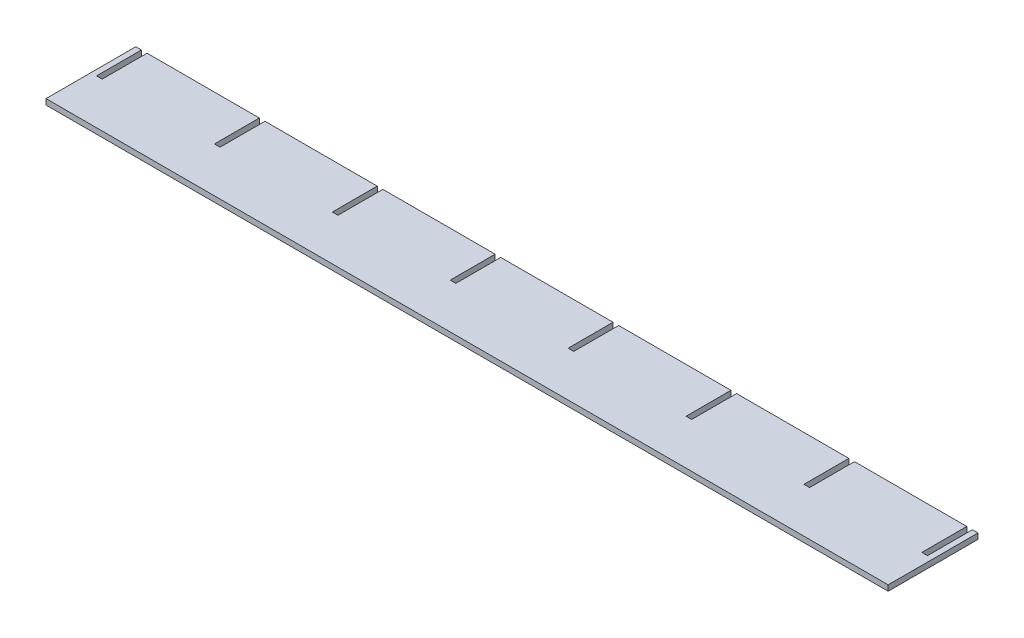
ISO-10303-21;
HEADER;
FILE_DESCRIPTION(('STEP AP214'),'2;1');
FILE_NAME('part.step','',(''),(''),'','','');
FILE_SCHEMA(('AUTOMOTIVE_DESIGN { 1 0 10303 214 1 1 1 1 }'));
ENDSEC;
DATA;
#1=APPLICATION_CONTEXT('core data for automotive mechanical design processes');
#2=APPLICATION_PROTOCOL_DEFINITION('international standard','automotive_design',2000,#1);
#3=PRODUCT_CONTEXT('',#1,'mechanical');
#4=PRODUCT('Part','Part','',(#3));
#5=PRODUCT_RELATED_PRODUCT_CATEGORY('part','',(#4));
#6=PRODUCT_DEFINITION_FORMATION('','',#4);
#7=PRODUCT_DEFINITION_CONTEXT('part definition',#1,'design');
#8=PRODUCT_DEFINITION('design','',#6,#7);
#9=PRODUCT_DEFINITION_SHAPE('','',#8);
#10=(LENGTH_UNIT() NAMED_UNIT(*) SI_UNIT(.MILLI.,.METRE.));
#11=(NAMED_UNIT(*) PLANE_ANGLE_UNIT() SI_UNIT($,.RADIAN.));
#12=(NAMED_UNIT(*) SI_UNIT($,.STERADIAN.) SOLID_ANGLE_UNIT());
#13=UNCERTAINTY_MEASURE_WITH_UNIT(LENGTH_MEASURE(1.E-05),#10,'distance_accuracy_value','');
#14=(GEOMETRIC_REPRESENTATION_CONTEXT(3) GLOBAL_UNCERTAINTY_ASSIGNED_CONTEXT((#13)) GLOBAL_UNIT_ASSIGNED_CONTEXT((#10,
#11,#12)) REPRESENTATION_CONTEXT('',''));
#15=CARTESIAN_POINT('',(0.,0.,0.));
#16=DIRECTION('',(0.,0.,1.));
#17=DIRECTION('',(1.,0.,0.));
#18=AXIS2_PLACEMENT_3D('',#15,#16,#17);
#19=CARTESIAN_POINT('',(0.,6.35,0.));
#20=DIRECTION('',(0.,0.,-1.));
#21=DIRECTION('',(-1.,0.,0.));
#22=AXIS2_PLACEMENT_3D('',#19,#20,#21);
#23=PLANE('',#22);
#24=DIRECTION('',(1.,0.,0.));
#25=VECTOR('',#24,1.);
#26=CARTESIAN_POINT('',(0.,0.,0.));
#27=LINE('',#26,#25);
#28=CARTESIAN_POINT('',(0.,0.,0.));
#29=VERTEX_POINT('',#28);
#30=CARTESIAN_POINT('',(952.5,0.,0.));
#31=VERTEX_POINT('',#30);
#32=EDGE_CURVE('E303',#29,#31,#27,.T.);
#33=ORIENTED_EDGE('',*,*,#32,.T.);
#34=DIRECTION('',(0.,-1.,0.));
#35=VECTOR('',#34,1.);
#36=CARTESIAN_POINT('',(952.5,6.35,0.));
#37=LINE('',#36,#35);
#38=CARTESIAN_POINT('',(952.5,6.35,0.));
#39=VERTEX_POINT('',#38);
#40=EDGE_CURVE('E11',#39,#31,#37,.T.);
#41=ORIENTED_EDGE('',*,*,#40,.F.);
#42=DIRECTION('',(1.,0.,0.));
#43=VECTOR('',#42,1.);
#44=CARTESIAN_POINT('',(0.,6.35,0.));
#45=LINE('',#44,#43);
#46=CARTESIAN_POINT('',(0.,6.35,0.));
#47=VERTEX_POINT('',#46);
#48=EDGE_CURVE('E373',#47,#39,#45,.T.);
#49=ORIENTED_EDGE('',*,*,#48,.F.);
#50=DIRECTION('',(0.,-1.,0.));
#51=VECTOR('',#50,1.);
#52=CARTESIAN_POINT('',(0.,6.35,0.));
#53=LINE('',#52,#51);
#54=EDGE_CURVE('E299',#47,#29,#53,.T.);
#55=ORIENTED_EDGE('',*,*,#54,.T.);
#56=EDGE_LOOP('',(#33,#41,#49,#55));
#57=FACE_BOUND('',#56,.T.);
#58=ADVANCED_FACE('F39',(#57),#23,.F.);
#59=CARTESIAN_POINT('',(952.5,6.35,-101.6));
#60=DIRECTION('',(-1.,0.,0.));
#61=DIRECTION('',(0.,0.,1.));
#62=AXIS2_PLACEMENT_3D('',#59,#60,#61);
#63=PLANE('',#62);
#64=DIRECTION('',(0.,0.,-1.));
#65=VECTOR('',#64,1.);
#66=CARTESIAN_POINT('',(952.5,0.,-101.6));
#67=LINE('',#66,#65);
#68=CARTESIAN_POINT('',(952.5,0.,-101.6));
#69=VERTEX_POINT('',#68);
#70=EDGE_CURVE('E306',#31,#69,#67,.T.);
#71=ORIENTED_EDGE('',*,*,#70,.T.);
#72=DIRECTION('',(0.,-1.,0.));
#73=VECTOR('',#72,1.);
#74=CARTESIAN_POINT('',(952.5,6.35,-101.6));
#75=LINE('',#74,#73);
#76=CARTESIAN_POINT('',(952.5,6.35,-101.6));
#77=VERTEX_POINT('',#76);
#78=EDGE_CURVE('E47',#77,#69,#75,.T.);
#79=ORIENTED_EDGE('',*,*,#78,.F.);
#80=DIRECTION('',(0.,0.,-1.));
#81=VECTOR('',#80,1.);
#82=CARTESIAN_POINT('',(952.5,6.35,-101.6));
#83=LINE('',#82,#81);
#84=EDGE_CURVE('E182',#39,#77,#83,.T.);
#85=ORIENTED_EDGE('',*,*,#84,.F.);
#86=ORIENTED_EDGE('',*,*,#40,.T.);
#87=EDGE_LOOP('',(#71,#79,#85,#86));
#88=FACE_BOUND('',#87,.T.);
#89=ADVANCED_FACE('F571',(#88),#63,.F.);
#90=CARTESIAN_POINT('',(946.15,6.35,-101.6));
#91=DIRECTION('',(0.,0.,1.));
#92=DIRECTION('',(1.,0.,0.));
#93=AXIS2_PLACEMENT_3D('',#90,#91,#92);
#94=PLANE('',#93);
#95=DIRECTION('',(-1.,0.,0.));
#96=VECTOR('',#95,1.);
#97=CARTESIAN_POINT('',(946.15,0.,-101.6));
#98=LINE('',#97,#96);
#99=CARTESIAN_POINT('',(946.15,0.,-101.6));
#100=VERTEX_POINT('',#99);
#101=EDGE_CURVE('E308',#69,#100,#98,.T.);
#102=ORIENTED_EDGE('',*,*,#101,.T.);
#103=DIRECTION('',(0.,-1.,0.));
#104=VECTOR('',#103,1.);
#105=CARTESIAN_POINT('',(946.15,6.35,-101.6));
#106=LINE('',#105,#104);
#107=CARTESIAN_POINT('',(946.15,6.35,-101.6));
#108=VERTEX_POINT('',#107);
#109=EDGE_CURVE('E464',#108,#100,#106,.T.);
#110=ORIENTED_EDGE('',*,*,#109,.F.);
#111=DIRECTION('',(-1.,0.,0.));
#112=VECTOR('',#111,1.);
#113=CARTESIAN_POINT('',(946.15,6.35,-101.6));
#114=LINE('',#113,#112);
#115=EDGE_CURVE('E472',#77,#108,#114,.T.);
#116=ORIENTED_EDGE('',*,*,#115,.F.);
#117=ORIENTED_EDGE('',*,*,#78,.T.);
#118=EDGE_LOOP('',(#102,#110,#116,#117));
#119=FACE_BOUND('',#118,.T.);
#120=ADVANCED_FACE('F470',(#119),#94,.F.);
#121=CARTESIAN_POINT('',(946.15,6.35,-50.8));
#122=DIRECTION('',(1.,0.,0.));
#123=DIRECTION('',(0.,0.,-1.));
#124=AXIS2_PLACEMENT_3D('',#121,#122,#123);
#125=PLANE('',#124);
#126=DIRECTION('',(0.,0.,1.));
#127=VECTOR('',#126,1.);
#128=CARTESIAN_POINT('',(946.15,0.,-50.8));
#129=LINE('',#128,#127);
#130=CARTESIAN_POINT('',(946.15,0.,-50.8));
#131=VERTEX_POINT('',#130);
#132=EDGE_CURVE('E310',#100,#131,#129,.T.);
#133=ORIENTED_EDGE('',*,*,#132,.T.);
#134=DIRECTION('',(0.,-1.,0.));
#135=VECTOR('',#134,1.);
#136=CARTESIAN_POINT('',(946.15,6.35,-50.8));
#137=LINE('',#136,#135);
#138=CARTESIAN_POINT('',(946.15,6.35,-50.8));
#139=VERTEX_POINT('',#138);
#140=EDGE_CURVE('E461',#139,#131,#137,.T.);
#141=ORIENTED_EDGE('',*,*,#140,.F.);
#142=DIRECTION('',(0.,0.,1.));
#143=VECTOR('',#142,1.);
#144=CARTESIAN_POINT('',(946.15,6.35,-50.8));
#145=LINE('',#144,#143);
#146=EDGE_CURVE('E490',#108,#139,#145,.T.);
#147=ORIENTED_EDGE('',*,*,#146,.F.);
#148=ORIENTED_EDGE('',*,*,#109,.T.);
#149=EDGE_LOOP('',(#133,#141,#147,#148));
#150=FACE_BOUND('',#149,.T.);
#151=ADVANCED_FACE('F481',(#150),#125,.F.);
#152=CARTESIAN_POINT('',(939.8,6.35,-50.8));
#153=DIRECTION('',(0.,0.,1.));
#154=DIRECTION('',(1.,0.,0.));
#155=AXIS2_PLACEMENT_3D('',#152,#153,#154);
#156=PLANE('',#155);
#157=DIRECTION('',(-1.,0.,0.));
#158=VECTOR('',#157,1.);
#159=CARTESIAN_POINT('',(939.8,0.,-50.8));
#160=LINE('',#159,#158);
#161=CARTESIAN_POINT('',(939.8,0.,-50.8));
#162=VERTEX_POINT('',#161);
#163=EDGE_CURVE('E312',#131,#162,#160,.T.);
#164=ORIENTED_EDGE('',*,*,#163,.T.);
#165=DIRECTION('',(0.,-1.,0.));
#166=VECTOR('',#165,1.);
#167=CARTESIAN_POINT('',(939.8,6.35,-50.8));
#168=LINE('',#167,#166);
#169=CARTESIAN_POINT('',(939.8,6.35,-50.8));
#170=VERTEX_POINT('',#169);
#171=EDGE_CURVE('E458',#170,#162,#168,.T.);
#172=ORIENTED_EDGE('',*,*,#171,.F.);
#173=DIRECTION('',(-1.,0.,0.));
#174=VECTOR('',#173,1.);
#175=CARTESIAN_POINT('',(939.8,6.35,-50.8));
#176=LINE('',#175,#174);
#177=EDGE_CURVE('E487',#139,#170,#176,.T.);
#178=ORIENTED_EDGE('',*,*,#177,.F.);
#179=ORIENTED_EDGE('',*,*,#140,.T.);
#180=EDGE_LOOP('',(#164,#172,#178,#179));
#181=FACE_BOUND('',#180,.T.);
#182=ADVANCED_FACE('F485',(#181),#156,.F.);
#183=CARTESIAN_POINT('',(939.8,6.35,-101.6));
#184=DIRECTION('',(-1.,0.,0.));
#185=DIRECTION('',(0.,0.,1.));
#186=AXIS2_PLACEMENT_3D('',#183,#184,#185);
#187=PLANE('',#186);
#188=DIRECTION('',(0.,0.,-1.));
#189=VECTOR('',#188,1.);
#190=CARTESIAN_POINT('',(939.8,0.,-101.6));
#191=LINE('',#190,#189);
#192=CARTESIAN_POINT('',(939.8,0.,-101.6));
#193=VERTEX_POINT('',#192);
#194=EDGE_CURVE('E314',#162,#193,#191,.T.);
#195=ORIENTED_EDGE('',*,*,#194,.T.);
#196=DIRECTION('',(0.,-1.,0.));
#197=VECTOR('',#196,1.);
#198=CARTESIAN_POINT('',(939.8,6.35,-101.6));
#199=LINE('',#198,#197);
#200=CARTESIAN_POINT('',(939.8,6.35,-101.6));
#201=VERTEX_POINT('',#200);
#202=EDGE_CURVE('E455',#201,#193,#199,.T.);
#203=ORIENTED_EDGE('',*,*,#202,.F.);
#204=DIRECTION('',(0.,0.,-1.));
#205=VECTOR('',#204,1.);
#206=CARTESIAN_POINT('',(939.8,6.35,-101.6));
#207=LINE('',#206,#205);
#208=EDGE_CURVE('E489',#170,#201,#207,.T.);
#209=ORIENTED_EDGE('',*,*,#208,.F.);
#210=ORIENTED_EDGE('',*,*,#171,.T.);
#211=EDGE_LOOP('',(#195,#203,#209,#210));
#212=FACE_BOUND('',#211,.T.);
#213=ADVANCED_FACE('F584',(#212),#187,.F.);
#214=CARTESIAN_POINT('',(812.8,6.35,-101.6));
#215=DIRECTION('',(0.,0.,1.));
#216=DIRECTION('',(1.,0.,0.));
#217=AXIS2_PLACEMENT_3D('',#214,#215,#216);
#218=PLANE('',#217);
#219=DIRECTION('',(-1.,0.,0.));
#220=VECTOR('',#219,1.);
#221=CARTESIAN_POINT('',(812.8,0.,-101.6));
#222=LINE('',#221,#220);
#223=CARTESIAN_POINT('',(812.8,0.,-101.6));
#224=VERTEX_POINT('',#223);
#225=EDGE_CURVE('E316',#193,#224,#222,.T.);
#226=ORIENTED_EDGE('',*,*,#225,.T.);
#227=DIRECTION('',(0.,-1.,0.));
#228=VECTOR('',#227,1.);
#229=CARTESIAN_POINT('',(812.8,6.35,-101.6));
#230=LINE('',#229,#228);
#231=CARTESIAN_POINT('',(812.8,6.35,-101.6));
#232=VERTEX_POINT('',#231);
#233=EDGE_CURVE('E452',#232,#224,#230,.T.);
#234=ORIENTED_EDGE('',*,*,#233,.F.);
#235=DIRECTION('',(-1.,0.,0.));
#236=VECTOR('',#235,1.);
#237=CARTESIAN_POINT('',(812.8,6.35,-101.6));
#238=LINE('',#237,#236);
#239=EDGE_CURVE('E492',#201,#232,#238,.T.);
#240=ORIENTED_EDGE('',*,*,#239,.F.);
#241=ORIENTED_EDGE('',*,*,#202,.T.);
#242=EDGE_LOOP('',(#226,#234,#240,#241));
#243=FACE_BOUND('',#242,.T.);
#244=ADVANCED_FACE('F587',(#243),#218,.F.);
#245=CARTESIAN_POINT('',(812.8,6.35,-50.8));
#246=DIRECTION('',(1.,0.,0.));
#247=DIRECTION('',(0.,0.,-1.));
#248=AXIS2_PLACEMENT_3D('',#245,#246,#247);
#249=PLANE('',#248);
#250=DIRECTION('',(0.,0.,1.));
#251=VECTOR('',#250,1.);
#252=CARTESIAN_POINT('',(812.8,0.,-50.8));
#253=LINE('',#252,#251);
#254=CARTESIAN_POINT('',(812.8,0.,-50.8));
#255=VERTEX_POINT('',#254);
#256=EDGE_CURVE('E318',#224,#255,#253,.T.);
#257=ORIENTED_EDGE('',*,*,#256,.T.);
#258=DIRECTION('',(0.,-1.,0.));
#259=VECTOR('',#258,1.);
#260=CARTESIAN_POINT('',(812.8,6.35,-50.8));
#261=LINE('',#260,#259);
#262=CARTESIAN_POINT('',(812.8,6.35,-50.8));
#263=VERTEX_POINT('',#262);
#264=EDGE_CURVE('E449',#263,#255,#261,.T.);
#265=ORIENTED_EDGE('',*,*,#264,.F.);
#266=DIRECTION('',(0.,0.,1.));
#267=VECTOR('',#266,1.);
#268=CARTESIAN_POINT('',(812.8,6.35,-50.8));
#269=LINE('',#268,#267);
#270=EDGE_CURVE('E498',#232,#263,#269,.T.);
#271=ORIENTED_EDGE('',*,*,#270,.F.);
#272=ORIENTED_EDGE('',*,*,#233,.T.);
#273=EDGE_LOOP('',(#257,#265,#271,#272));
#274=FACE_BOUND('',#273,.T.);
#275=ADVANCED_FACE('F591',(#274),#249,.F.);
#276=CARTESIAN_POINT('',(806.45,6.35,-50.8));
#277=DIRECTION('',(0.,0.,1.));
#278=DIRECTION('',(1.,0.,0.));
#279=AXIS2_PLACEMENT_3D('',#276,#277,#278);
#280=PLANE('',#279);
#281=DIRECTION('',(-1.,0.,0.));
#282=VECTOR('',#281,1.);
#283=CARTESIAN_POINT('',(806.45,0.,-50.8));
#284=LINE('',#283,#282);
#285=CARTESIAN_POINT('',(806.45,0.,-50.8));
#286=VERTEX_POINT('',#285);
#287=EDGE_CURVE('E320',#255,#286,#284,.T.);
#288=ORIENTED_EDGE('',*,*,#287,.T.);
#289=DIRECTION('',(0.,-1.,0.));
#290=VECTOR('',#289,1.);
#291=CARTESIAN_POINT('',(806.45,6.35,-50.8));
#292=LINE('',#291,#290);
#293=CARTESIAN_POINT('',(806.45,6.35,-50.8));
#294=VERTEX_POINT('',#293);
#295=EDGE_CURVE('E446',#294,#286,#292,.T.);
#296=ORIENTED_EDGE('',*,*,#295,.F.);
#297=DIRECTION('',(-1.,0.,0.));
#298=VECTOR('',#297,1.);
#299=CARTESIAN_POINT('',(806.45,6.35,-50.8));
#300=LINE('',#299,#298);
#301=EDGE_CURVE('E500',#263,#294,#300,.T.);
#302=ORIENTED_EDGE('',*,*,#301,.F.);
#303=ORIENTED_EDGE('',*,*,#264,.T.);
#304=EDGE_LOOP('',(#288,#296,#302,#303));
#305=FACE_BOUND('',#304,.T.);
#306=ADVANCED_FACE('F595',(#305),#280,.F.);
#307=CARTESIAN_POINT('',(806.45,6.35,-101.6));
#308=DIRECTION('',(-1.,0.,0.));
#309=DIRECTION('',(0.,0.,1.));
#310=AXIS2_PLACEMENT_3D('',#307,#308,#309);
#311=PLANE('',#310);
#312=DIRECTION('',(0.,0.,-1.));
#313=VECTOR('',#312,1.);
#314=CARTESIAN_POINT('',(806.45,0.,-101.6));
#315=LINE('',#314,#313);
#316=CARTESIAN_POINT('',(806.45,0.,-101.6));
#317=VERTEX_POINT('',#316);
#318=EDGE_CURVE('E322',#286,#317,#315,.T.);
#319=ORIENTED_EDGE('',*,*,#318,.T.);
#320=DIRECTION('',(0.,-1.,0.));
#321=VECTOR('',#320,1.);
#322=CARTESIAN_POINT('',(806.45,6.35,-101.6));
#323=LINE('',#322,#321);
#324=CARTESIAN_POINT('',(806.45,6.35,-101.6));
#325=VERTEX_POINT('',#324);
#326=EDGE_CURVE('E443',#325,#317,#323,.T.);
#327=ORIENTED_EDGE('',*,*,#326,.F.);
#328=DIRECTION('',(0.,0.,-1.));
#329=VECTOR('',#328,1.);
#330=CARTESIAN_POINT('',(806.45,6.35,-101.6));
#331=LINE('',#330,#329);
#332=EDGE_CURVE('E502',#294,#325,#331,.T.);
#333=ORIENTED_EDGE('',*,*,#332,.F.);
#334=ORIENTED_EDGE('',*,*,#295,.T.);
#335=EDGE_LOOP('',(#319,#327,#333,#334));
#336=FACE_BOUND('',#335,.T.);
#337=ADVANCED_FACE('F599',(#336),#311,.F.);
#338=CARTESIAN_POINT('',(679.45,6.35,-101.6));
#339=DIRECTION('',(0.,0.,1.));
#340=DIRECTION('',(1.,0.,0.));
#341=AXIS2_PLACEMENT_3D('',#338,#339,#340);
#342=PLANE('',#341);
#343=DIRECTION('',(-1.,0.,0.));
#344=VECTOR('',#343,1.);
#345=CARTESIAN_POINT('',(679.45,0.,-101.6));
#346=LINE('',#345,#344);
#347=CARTESIAN_POINT('',(679.45,0.,-101.6));
#348=VERTEX_POINT('',#347);
#349=EDGE_CURVE('E324',#317,#348,#346,.T.);
#350=ORIENTED_EDGE('',*,*,#349,.T.);
#351=DIRECTION('',(0.,-1.,0.));
#352=VECTOR('',#351,1.);
#353=CARTESIAN_POINT('',(679.45,6.35,-101.6));
#354=LINE('',#353,#352);
#355=CARTESIAN_POINT('',(679.45,6.35,-101.6));
#356=VERTEX_POINT('',#355);
#357=EDGE_CURVE('E440',#356,#348,#354,.T.);
#358=ORIENTED_EDGE('',*,*,#357,.F.);
#359=DIRECTION('',(-1.,0.,0.));
#360=VECTOR('',#359,1.);
#361=CARTESIAN_POINT('',(679.45,6.35,-101.6));
#362=LINE('',#361,#360);
#363=EDGE_CURVE('E504',#325,#356,#362,.T.);
#364=ORIENTED_EDGE('',*,*,#363,.F.);
#365=ORIENTED_EDGE('',*,*,#326,.T.);
#366=EDGE_LOOP('',(#350,#358,#364,#365));
#367=FACE_BOUND('',#366,.T.);
#368=ADVANCED_FACE('F603',(#367),#342,.F.);
#369=CARTESIAN_POINT('',(679.45,6.35,-50.8));
#370=DIRECTION('',(1.,0.,0.));
#371=DIRECTION('',(0.,0.,-1.));
#372=AXIS2_PLACEMENT_3D('',#369,#370,#371);
#373=PLANE('',#372);
#374=DIRECTION('',(0.,0.,1.));
#375=VECTOR('',#374,1.);
#376=CARTESIAN_POINT('',(679.45,0.,-50.8));
#377=LINE('',#376,#375);
#378=CARTESIAN_POINT('',(679.45,0.,-50.8));
#379=VERTEX_POINT('',#378);
#380=EDGE_CURVE('E326',#348,#379,#377,.T.);
#381=ORIENTED_EDGE('',*,*,#380,.T.);
#382=DIRECTION('',(0.,-1.,0.));
#383=VECTOR('',#382,1.);
#384=CARTESIAN_POINT('',(679.45,6.35,-50.8));
#385=LINE('',#384,#383);
#386=CARTESIAN_POINT('',(679.45,6.35,-50.8));
#387=VERTEX_POINT('',#386);
#388=EDGE_CURVE('E437',#387,#379,#385,.T.);
#389=ORIENTED_EDGE('',*,*,#388,.F.);
#390=DIRECTION('',(0.,0.,1.));
#391=VECTOR('',#390,1.);
#392=CARTESIAN_POINT('',(679.45,6.35,-50.8));
#393=LINE('',#392,#391);
#394=EDGE_CURVE('E506',#356,#387,#393,.T.);
#395=ORIENTED_EDGE('',*,*,#394,.F.);
#396=ORIENTED_EDGE('',*,*,#357,.T.);
#397=EDGE_LOOP('',(#381,#389,#395,#396));
#398=FACE_BOUND('',#397,.T.);
#399=ADVANCED_FACE('F607',(#398),#373,.F.);
#400=CARTESIAN_POINT('',(673.1,6.35,-50.8));
#401=DIRECTION('',(0.,0.,1.));
#402=DIRECTION('',(1.,0.,0.));
#403=AXIS2_PLACEMENT_3D('',#400,#401,#402);
#404=PLANE('',#403);
#405=DIRECTION('',(-1.,0.,0.));
#406=VECTOR('',#405,1.);
#407=CARTESIAN_POINT('',(673.1,0.,-50.8));
#408=LINE('',#407,#406);
#409=CARTESIAN_POINT('',(673.1,0.,-50.8));
#410=VERTEX_POINT('',#409);
#411=EDGE_CURVE('E328',#379,#410,#408,.T.);
#412=ORIENTED_EDGE('',*,*,#411,.T.);
#413=DIRECTION('',(0.,-1.,0.));
#414=VECTOR('',#413,1.);
#415=CARTESIAN_POINT('',(673.1,6.35,-50.8));
#416=LINE('',#415,#414);
#417=CARTESIAN_POINT('',(673.1,6.35,-50.8));
#418=VERTEX_POINT('',#417);
#419=EDGE_CURVE('E434',#418,#410,#416,.T.);
#420=ORIENTED_EDGE('',*,*,#419,.F.);
#421=DIRECTION('',(-1.,0.,0.));
#422=VECTOR('',#421,1.);
#423=CARTESIAN_POINT('',(673.1,6.35,-50.8));
#424=LINE('',#423,#422);
#425=EDGE_CURVE('E508',#387,#418,#424,.T.);
#426=ORIENTED_EDGE('',*,*,#425,.F.);
#427=ORIENTED_EDGE('',*,*,#388,.T.);
#428=EDGE_LOOP('',(#412,#420,#426,#427));
#429=FACE_BOUND('',#428,.T.);
#430=ADVANCED_FACE('F611',(#429),#404,.F.);
#431=CARTESIAN_POINT('',(673.1,6.35,-101.6));
#432=DIRECTION('',(-1.,0.,0.));
#433=DIRECTION('',(0.,0.,1.));
#434=AXIS2_PLACEMENT_3D('',#431,#432,#433);
#435=PLANE('',#434);
#436=DIRECTION('',(0.,0.,-1.));
#437=VECTOR('',#436,1.);
#438=CARTESIAN_POINT('',(673.1,0.,-101.6));
#439=LINE('',#438,#437);
#440=CARTESIAN_POINT('',(673.1,0.,-101.6));
#441=VERTEX_POINT('',#440);
#442=EDGE_CURVE('E330',#410,#441,#439,.T.);
#443=ORIENTED_EDGE('',*,*,#442,.T.);
#444=DIRECTION('',(0.,-1.,0.));
#445=VECTOR('',#444,1.);
#446=CARTESIAN_POINT('',(673.1,6.35,-101.6));
#447=LINE('',#446,#445);
#448=CARTESIAN_POINT('',(673.1,6.35,-101.6));
#449=VERTEX_POINT('',#448);
#450=EDGE_CURVE('E431',#449,#441,#447,.T.);
#451=ORIENTED_EDGE('',*,*,#450,.F.);
#452=DIRECTION('',(0.,0.,-1.));
#453=VECTOR('',#452,1.);
#454=CARTESIAN_POINT('',(673.1,6.35,-101.6));
#455=LINE('',#454,#453);
#456=EDGE_CURVE('E510',#418,#449,#455,.T.);
#457=ORIENTED_EDGE('',*,*,#456,.F.);
#458=ORIENTED_EDGE('',*,*,#419,.T.);
#459=EDGE_LOOP('',(#443,#451,#457,#458));
#460=FACE_BOUND('',#459,.T.);
#461=ADVANCED_FACE('F615',(#460),#435,.F.);
#462=CARTESIAN_POINT('',(546.1,6.35,-101.6));
#463=DIRECTION('',(0.,0.,1.));
#464=DIRECTION('',(1.,0.,0.));
#465=AXIS2_PLACEMENT_3D('',#462,#463,#464);
#466=PLANE('',#465);
#467=DIRECTION('',(-1.,0.,0.));
#468=VECTOR('',#467,1.);
#469=CARTESIAN_POINT('',(546.1,0.,-101.6));
#470=LINE('',#469,#468);
#471=CARTESIAN_POINT('',(546.1,0.,-101.6));
#472=VERTEX_POINT('',#471);
#473=EDGE_CURVE('E332',#441,#472,#470,.T.);
#474=ORIENTED_EDGE('',*,*,#473,.T.);
#475=DIRECTION('',(0.,-1.,0.));
#476=VECTOR('',#475,1.);
#477=CARTESIAN_POINT('',(546.1,6.35,-101.6));
#478=LINE('',#477,#476);
#479=CARTESIAN_POINT('',(546.1,6.35,-101.6));
#480=VERTEX_POINT('',#479);
#481=EDGE_CURVE('E428',#480,#472,#478,.T.);
#482=ORIENTED_EDGE('',*,*,#481,.F.);
#483=DIRECTION('',(-1.,0.,0.));
#484=VECTOR('',#483,1.);
#485=CARTESIAN_POINT('',(546.1,6.35,-101.6));
#486=LINE('',#485,#484);
#487=EDGE_CURVE('E512',#449,#480,#486,.T.);
#488=ORIENTED_EDGE('',*,*,#487,.F.);
#489=ORIENTED_EDGE('',*,*,#450,.T.);
#490=EDGE_LOOP('',(#474,#482,#488,#489));
#491=FACE_BOUND('',#490,.T.);
#492=ADVANCED_FACE('F619',(#491),#466,.F.);
#493=CARTESIAN_POINT('',(546.1,6.35,-50.8));
#494=DIRECTION('',(1.,0.,0.));
#495=DIRECTION('',(0.,0.,-1.));
#496=AXIS2_PLACEMENT_3D('',#493,#494,#495);
#497=PLANE('',#496);
#498=DIRECTION('',(0.,0.,1.));
#499=VECTOR('',#498,1.);
#500=CARTESIAN_POINT('',(546.1,0.,-50.8));
#501=LINE('',#500,#499);
#502=CARTESIAN_POINT('',(546.1,0.,-50.8));
#503=VERTEX_POINT('',#502);
#504=EDGE_CURVE('E334',#472,#503,#501,.T.);
#505=ORIENTED_EDGE('',*,*,#504,.T.);
#506=DIRECTION('',(0.,-1.,0.));
#507=VECTOR('',#506,1.);
#508=CARTESIAN_POINT('',(546.1,6.35,-50.8));
#509=LINE('',#508,#507);
#510=CARTESIAN_POINT('',(546.1,6.35,-50.8));
#511=VERTEX_POINT('',#510);
#512=EDGE_CURVE('E425',#511,#503,#509,.T.);
#513=ORIENTED_EDGE('',*,*,#512,.F.);
#514=DIRECTION('',(0.,0.,1.));
#515=VECTOR('',#514,1.);
#516=CARTESIAN_POINT('',(546.1,6.35,-50.8));
#517=LINE('',#516,#515);
#518=EDGE_CURVE('E514',#480,#511,#517,.T.);
#519=ORIENTED_EDGE('',*,*,#518,.F.);
#520=ORIENTED_EDGE('',*,*,#481,.T.);
#521=EDGE_LOOP('',(#505,#513,#519,#520));
#522=FACE_BOUND('',#521,.T.);
#523=ADVANCED_FACE('F623',(#522),#497,.F.);
#524=CARTESIAN_POINT('',(539.75,6.35,-50.8));
#525=DIRECTION('',(0.,0.,1.));
#526=DIRECTION('',(1.,0.,0.));
#527=AXIS2_PLACEMENT_3D('',#524,#525,#526);
#528=PLANE('',#527);
#529=DIRECTION('',(-1.,0.,0.));
#530=VECTOR('',#529,1.);
#531=CARTESIAN_POINT('',(539.75,0.,-50.8));
#532=LINE('',#531,#530);
#533=CARTESIAN_POINT('',(539.75,0.,-50.8));
#534=VERTEX_POINT('',#533);
#535=EDGE_CURVE('E336',#503,#534,#532,.T.);
#536=ORIENTED_EDGE('',*,*,#535,.T.);
#537=DIRECTION('',(0.,-1.,0.));
#538=VECTOR('',#537,1.);
#539=CARTESIAN_POINT('',(539.75,6.35,-50.8));
#540=LINE('',#539,#538);
#541=CARTESIAN_POINT('',(539.75,6.35,-50.8));
#542=VERTEX_POINT('',#541);
#543=EDGE_CURVE('E422',#542,#534,#540,.T.);
#544=ORIENTED_EDGE('',*,*,#543,.F.);
#545=DIRECTION('',(-1.,0.,0.));
#546=VECTOR('',#545,1.);
#547=CARTESIAN_POINT('',(539.75,6.35,-50.8));
#548=LINE('',#547,#546);
#549=EDGE_CURVE('E516',#511,#542,#548,.T.);
#550=ORIENTED_EDGE('',*,*,#549,.F.);
#551=ORIENTED_EDGE('',*,*,#512,.T.);
#552=EDGE_LOOP('',(#536,#544,#550,#551));
#553=FACE_BOUND('',#552,.T.);
#554=ADVANCED_FACE('F627',(#553),#528,.F.);
#555=CARTESIAN_POINT('',(539.75,6.35,-101.6));
#556=DIRECTION('',(-1.,0.,0.));
#557=DIRECTION('',(0.,0.,1.));
#558=AXIS2_PLACEMENT_3D('',#555,#556,#557);
#559=PLANE('',#558);
#560=DIRECTION('',(0.,0.,-1.));
#561=VECTOR('',#560,1.);
#562=CARTESIAN_POINT('',(539.75,0.,-101.6));
#563=LINE('',#562,#561);
#564=CARTESIAN_POINT('',(539.75,0.,-101.6));
#565=VERTEX_POINT('',#564);
#566=EDGE_CURVE('E338',#534,#565,#563,.T.);
#567=ORIENTED_EDGE('',*,*,#566,.T.);
#568=DIRECTION('',(0.,-1.,0.));
#569=VECTOR('',#568,1.);
#570=CARTESIAN_POINT('',(539.75,6.35,-101.6));
#571=LINE('',#570,#569);
#572=CARTESIAN_POINT('',(539.75,6.35,-101.6));
#573=VERTEX_POINT('',#572);
#574=EDGE_CURVE('E419',#573,#565,#571,.T.);
#575=ORIENTED_EDGE('',*,*,#574,.F.);
#576=DIRECTION('',(0.,0.,-1.));
#577=VECTOR('',#576,1.);
#578=CARTESIAN_POINT('',(539.75,6.35,-101.6));
#579=LINE('',#578,#577);
#580=EDGE_CURVE('E518',#542,#573,#579,.T.);
#581=ORIENTED_EDGE('',*,*,#580,.F.);
#582=ORIENTED_EDGE('',*,*,#543,.T.);
#583=EDGE_LOOP('',(#567,#575,#581,#582));
#584=FACE_BOUND('',#583,.T.);
#585=ADVANCED_FACE('F631',(#584),#559,.F.);
#586=CARTESIAN_POINT('',(412.75,6.35,-101.6));
#587=DIRECTION('',(0.,0.,1.));
#588=DIRECTION('',(1.,0.,0.));
#589=AXIS2_PLACEMENT_3D('',#586,#587,#588);
#590=PLANE('',#589);
#591=DIRECTION('',(-1.,0.,0.));
#592=VECTOR('',#591,1.);
#593=CARTESIAN_POINT('',(412.75,0.,-101.6));
#594=LINE('',#593,#592);
#595=CARTESIAN_POINT('',(412.75,0.,-101.6));
#596=VERTEX_POINT('',#595);
#597=EDGE_CURVE('E340',#565,#596,#594,.T.);
#598=ORIENTED_EDGE('',*,*,#597,.T.);
#599=DIRECTION('',(0.,-1.,0.));
#600=VECTOR('',#599,1.);
#601=CARTESIAN_POINT('',(412.75,6.35,-101.6));
#602=LINE('',#601,#600);
#603=CARTESIAN_POINT('',(412.75,6.35,-101.6));
#604=VERTEX_POINT('',#603);
#605=EDGE_CURVE('E416',#604,#596,#602,.T.);
#606=ORIENTED_EDGE('',*,*,#605,.F.);
#607=DIRECTION('',(-1.,0.,0.));
#608=VECTOR('',#607,1.);
#609=CARTESIAN_POINT('',(412.75,6.35,-101.6));
#610=LINE('',#609,#608);
#611=EDGE_CURVE('E520',#573,#604,#610,.T.);
#612=ORIENTED_EDGE('',*,*,#611,.F.);
#613=ORIENTED_EDGE('',*,*,#574,.T.);
#614=EDGE_LOOP('',(#598,#606,#612,#613));
#615=FACE_BOUND('',#614,.T.);
#616=ADVANCED_FACE('F635',(#615),#590,.F.);
#617=CARTESIAN_POINT('',(412.75,6.35,-50.8));
#618=DIRECTION('',(1.,0.,0.));
#619=DIRECTION('',(0.,0.,-1.));
#620=AXIS2_PLACEMENT_3D('',#617,#618,#619);
#621=PLANE('',#620);
#622=DIRECTION('',(0.,0.,1.));
#623=VECTOR('',#622,1.);
#624=CARTESIAN_POINT('',(412.75,0.,-50.8));
#625=LINE('',#624,#623);
#626=CARTESIAN_POINT('',(412.75,0.,-50.8));
#627=VERTEX_POINT('',#626);
#628=EDGE_CURVE('E342',#596,#627,#625,.T.);
#629=ORIENTED_EDGE('',*,*,#628,.T.);
#630=DIRECTION('',(0.,-1.,0.));
#631=VECTOR('',#630,1.);
#632=CARTESIAN_POINT('',(412.75,6.35,-50.8));
#633=LINE('',#632,#631);
#634=CARTESIAN_POINT('',(412.75,6.35,-50.8));
#635=VERTEX_POINT('',#634);
#636=EDGE_CURVE('E413',#635,#627,#633,.T.);
#637=ORIENTED_EDGE('',*,*,#636,.F.);
#638=DIRECTION('',(0.,0.,1.));
#639=VECTOR('',#638,1.);
#640=CARTESIAN_POINT('',(412.75,6.35,-50.8));
#641=LINE('',#640,#639);
#642=EDGE_CURVE('E522',#604,#635,#641,.T.);
#643=ORIENTED_EDGE('',*,*,#642,.F.);
#644=ORIENTED_EDGE('',*,*,#605,.T.);
#645=EDGE_LOOP('',(#629,#637,#643,#644));
#646=FACE_BOUND('',#645,.T.);
#647=ADVANCED_FACE('F639',(#646),#621,.F.);
#648=CARTESIAN_POINT('',(406.4,6.35,-50.8));
#649=DIRECTION('',(0.,0.,1.));
#650=DIRECTION('',(1.,0.,0.));
#651=AXIS2_PLACEMENT_3D('',#648,#649,#650);
#652=PLANE('',#651);
#653=DIRECTION('',(-1.,0.,0.));
#654=VECTOR('',#653,1.);
#655=CARTESIAN_POINT('',(406.4,0.,-50.8));
#656=LINE('',#655,#654);
#657=CARTESIAN_POINT('',(406.4,0.,-50.8));
#658=VERTEX_POINT('',#657);
#659=EDGE_CURVE('E344',#627,#658,#656,.T.);
#660=ORIENTED_EDGE('',*,*,#659,.T.);
#661=DIRECTION('',(0.,-1.,0.));
#662=VECTOR('',#661,1.);
#663=CARTESIAN_POINT('',(406.4,6.35,-50.8));
#664=LINE('',#663,#662);
#665=CARTESIAN_POINT('',(406.4,6.35,-50.8));
#666=VERTEX_POINT('',#665);
#667=EDGE_CURVE('E410',#666,#658,#664,.T.);
#668=ORIENTED_EDGE('',*,*,#667,.F.);
#669=DIRECTION('',(-1.,0.,0.));
#670=VECTOR('',#669,1.);
#671=CARTESIAN_POINT('',(406.4,6.35,-50.8));
#672=LINE('',#671,#670);
#673=EDGE_CURVE('E524',#635,#666,#672,.T.);
#674=ORIENTED_EDGE('',*,*,#673,.F.);
#675=ORIENTED_EDGE('',*,*,#636,.T.);
#676=EDGE_LOOP('',(#660,#668,#674,#675));
#677=FACE_BOUND('',#676,.T.);
#678=ADVANCED_FACE('F643',(#677),#652,.F.);
#679=CARTESIAN_POINT('',(406.4,6.35,-101.6));
#680=DIRECTION('',(-1.,0.,0.));
#681=DIRECTION('',(0.,0.,1.));
#682=AXIS2_PLACEMENT_3D('',#679,#680,#681);
#683=PLANE('',#682);
#684=DIRECTION('',(0.,0.,-1.));
#685=VECTOR('',#684,1.);
#686=CARTESIAN_POINT('',(406.4,0.,-101.6));
#687=LINE('',#686,#685);
#688=CARTESIAN_POINT('',(406.4,0.,-101.6));
#689=VERTEX_POINT('',#688);
#690=EDGE_CURVE('E346',#658,#689,#687,.T.);
#691=ORIENTED_EDGE('',*,*,#690,.T.);
#692=DIRECTION('',(0.,-1.,0.));
#693=VECTOR('',#692,1.);
#694=CARTESIAN_POINT('',(406.4,6.35,-101.6));
#695=LINE('',#694,#693);
#696=CARTESIAN_POINT('',(406.4,6.35,-101.6));
#697=VERTEX_POINT('',#696);
#698=EDGE_CURVE('E407',#697,#689,#695,.T.);
#699=ORIENTED_EDGE('',*,*,#698,.F.);
#700=DIRECTION('',(0.,0.,-1.));
#701=VECTOR('',#700,1.);
#702=CARTESIAN_POINT('',(406.4,6.35,-101.6));
#703=LINE('',#702,#701);
#704=EDGE_CURVE('E526',#666,#697,#703,.T.);
#705=ORIENTED_EDGE('',*,*,#704,.F.);
#706=ORIENTED_EDGE('',*,*,#667,.T.);
#707=EDGE_LOOP('',(#691,#699,#705,#706));
#708=FACE_BOUND('',#707,.T.);
#709=ADVANCED_FACE('F647',(#708),#683,.F.);
#710=CARTESIAN_POINT('',(279.4,6.35,-101.6));
#711=DIRECTION('',(0.,0.,1.));
#712=DIRECTION('',(1.,0.,0.));
#713=AXIS2_PLACEMENT_3D('',#710,#711,#712);
#714=PLANE('',#713);
#715=DIRECTION('',(-1.,0.,0.));
#716=VECTOR('',#715,1.);
#717=CARTESIAN_POINT('',(279.4,0.,-101.6));
#718=LINE('',#717,#716);
#719=CARTESIAN_POINT('',(279.4,0.,-101.6));
#720=VERTEX_POINT('',#719);
#721=EDGE_CURVE('E348',#689,#720,#718,.T.);
#722=ORIENTED_EDGE('',*,*,#721,.T.);
#723=DIRECTION('',(0.,-1.,0.));
#724=VECTOR('',#723,1.);
#725=CARTESIAN_POINT('',(279.4,6.35,-101.6));
#726=LINE('',#725,#724);
#727=CARTESIAN_POINT('',(279.4,6.35,-101.6));
#728=VERTEX_POINT('',#727);
#729=EDGE_CURVE('E404',#728,#720,#726,.T.);
#730=ORIENTED_EDGE('',*,*,#729,.F.);
#731=DIRECTION('',(-1.,0.,0.));
#732=VECTOR('',#731,1.);
#733=CARTESIAN_POINT('',(279.4,6.35,-101.6));
#734=LINE('',#733,#732);
#735=EDGE_CURVE('E528',#697,#728,#734,.T.);
#736=ORIENTED_EDGE('',*,*,#735,.F.);
#737=ORIENTED_EDGE('',*,*,#698,.T.);
#738=EDGE_LOOP('',(#722,#730,#736,#737));
#739=FACE_BOUND('',#738,.T.);
#740=ADVANCED_FACE('F651',(#739),#714,.F.);
#741=CARTESIAN_POINT('',(279.4,6.35,-50.8));
#742=DIRECTION('',(1.,0.,0.));
#743=DIRECTION('',(0.,0.,-1.));
#744=AXIS2_PLACEMENT_3D('',#741,#742,#743);
#745=PLANE('',#744);
#746=DIRECTION('',(0.,0.,1.));
#747=VECTOR('',#746,1.);
#748=CARTESIAN_POINT('',(279.4,0.,-50.8));
#749=LINE('',#748,#747);
#750=CARTESIAN_POINT('',(279.4,0.,-50.8));
#751=VERTEX_POINT('',#750);
#752=EDGE_CURVE('E350',#720,#751,#749,.T.);
#753=ORIENTED_EDGE('',*,*,#752,.T.);
#754=DIRECTION('',(0.,-1.,0.));
#755=VECTOR('',#754,1.);
#756=CARTESIAN_POINT('',(279.4,6.35,-50.8));
#757=LINE('',#756,#755);
#758=CARTESIAN_POINT('',(279.4,6.35,-50.8));
#759=VERTEX_POINT('',#758);
#760=EDGE_CURVE('E401',#759,#751,#757,.T.);
#761=ORIENTED_EDGE('',*,*,#760,.F.);
#762=DIRECTION('',(0.,0.,1.));
#763=VECTOR('',#762,1.);
#764=CARTESIAN_POINT('',(279.4,6.35,-50.8));
#765=LINE('',#764,#763);
#766=EDGE_CURVE('E530',#728,#759,#765,.T.);
#767=ORIENTED_EDGE('',*,*,#766,.F.);
#768=ORIENTED_EDGE('',*,*,#729,.T.);
#769=EDGE_LOOP('',(#753,#761,#767,#768));
#770=FACE_BOUND('',#769,.T.);
#771=ADVANCED_FACE('F655',(#770),#745,.F.);
#772=CARTESIAN_POINT('',(273.05,6.35,-50.8));
#773=DIRECTION('',(0.,0.,1.));
#774=DIRECTION('',(1.,0.,0.));
#775=AXIS2_PLACEMENT_3D('',#772,#773,#774);
#776=PLANE('',#775);
#777=DIRECTION('',(-1.,0.,0.));
#778=VECTOR('',#777,1.);
#779=CARTESIAN_POINT('',(273.05,0.,-50.8));
#780=LINE('',#779,#778);
#781=CARTESIAN_POINT('',(273.05,0.,-50.8));
#782=VERTEX_POINT('',#781);
#783=EDGE_CURVE('E352',#751,#782,#780,.T.);
#784=ORIENTED_EDGE('',*,*,#783,.T.);
#785=DIRECTION('',(0.,-1.,0.));
#786=VECTOR('',#785,1.);
#787=CARTESIAN_POINT('',(273.05,6.35,-50.8));
#788=LINE('',#787,#786);
#789=CARTESIAN_POINT('',(273.05,6.35,-50.8));
#790=VERTEX_POINT('',#789);
#791=EDGE_CURVE('E398',#790,#782,#788,.T.);
#792=ORIENTED_EDGE('',*,*,#791,.F.);
#793=DIRECTION('',(-1.,0.,0.));
#794=VECTOR('',#793,1.);
#795=CARTESIAN_POINT('',(273.05,6.35,-50.8));
#796=LINE('',#795,#794);
#797=EDGE_CURVE('E532',#759,#790,#796,.T.);
#798=ORIENTED_EDGE('',*,*,#797,.F.);
#799=ORIENTED_EDGE('',*,*,#760,.T.);
#800=EDGE_LOOP('',(#784,#792,#798,#799));
#801=FACE_BOUND('',#800,.T.);
#802=ADVANCED_FACE('F659',(#801),#776,.F.);
#803=CARTESIAN_POINT('',(273.05,6.35,-101.6));
#804=DIRECTION('',(-1.,0.,0.));
#805=DIRECTION('',(0.,0.,1.));
#806=AXIS2_PLACEMENT_3D('',#803,#804,#805);
#807=PLANE('',#806);
#808=DIRECTION('',(0.,0.,-1.));
#809=VECTOR('',#808,1.);
#810=CARTESIAN_POINT('',(273.05,0.,-101.6));
#811=LINE('',#810,#809);
#812=CARTESIAN_POINT('',(273.05,0.,-101.6));
#813=VERTEX_POINT('',#812);
#814=EDGE_CURVE('E354',#782,#813,#811,.T.);
#815=ORIENTED_EDGE('',*,*,#814,.T.);
#816=DIRECTION('',(0.,-1.,0.));
#817=VECTOR('',#816,1.);
#818=CARTESIAN_POINT('',(273.05,6.35,-101.6));
#819=LINE('',#818,#817);
#820=CARTESIAN_POINT('',(273.05,6.35,-101.6));
#821=VERTEX_POINT('',#820);
#822=EDGE_CURVE('E395',#821,#813,#819,.T.);
#823=ORIENTED_EDGE('',*,*,#822,.F.);
#824=DIRECTION('',(0.,0.,-1.));
#825=VECTOR('',#824,1.);
#826=CARTESIAN_POINT('',(273.05,6.35,-101.6));
#827=LINE('',#826,#825);
#828=EDGE_CURVE('E534',#790,#821,#827,.T.);
#829=ORIENTED_EDGE('',*,*,#828,.F.);
#830=ORIENTED_EDGE('',*,*,#791,.T.);
#831=EDGE_LOOP('',(#815,#823,#829,#830));
#832=FACE_BOUND('',#831,.T.);
#833=ADVANCED_FACE('F663',(#832),#807,.F.);
#834=CARTESIAN_POINT('',(146.05,6.35,-101.6));
#835=DIRECTION('',(0.,0.,1.));
#836=DIRECTION('',(1.,0.,0.));
#837=AXIS2_PLACEMENT_3D('',#834,#835,#836);
#838=PLANE('',#837);
#839=DIRECTION('',(-1.,0.,0.));
#840=VECTOR('',#839,1.);
#841=CARTESIAN_POINT('',(146.05,0.,-101.6));
#842=LINE('',#841,#840);
#843=CARTESIAN_POINT('',(146.05,0.,-101.6));
#844=VERTEX_POINT('',#843);
#845=EDGE_CURVE('E356',#813,#844,#842,.T.);
#846=ORIENTED_EDGE('',*,*,#845,.T.);
#847=DIRECTION('',(0.,-1.,0.));
#848=VECTOR('',#847,1.);
#849=CARTESIAN_POINT('',(146.05,6.35,-101.6));
#850=LINE('',#849,#848);
#851=CARTESIAN_POINT('',(146.05,6.35,-101.6));
#852=VERTEX_POINT('',#851);
#853=EDGE_CURVE('E392',#852,#844,#850,.T.);
#854=ORIENTED_EDGE('',*,*,#853,.F.);
#855=DIRECTION('',(-1.,0.,0.));
#856=VECTOR('',#855,1.);
#857=CARTESIAN_POINT('',(146.05,6.35,-101.6));
#858=LINE('',#857,#856);
#859=EDGE_CURVE('E536',#821,#852,#858,.T.);
#860=ORIENTED_EDGE('',*,*,#859,.F.);
#861=ORIENTED_EDGE('',*,*,#822,.T.);
#862=EDGE_LOOP('',(#846,#854,#860,#861));
#863=FACE_BOUND('',#862,.T.);
#864=ADVANCED_FACE('F667',(#863),#838,.F.);
#865=CARTESIAN_POINT('',(146.05,6.35,-50.8));
#866=DIRECTION('',(1.,0.,0.));
#867=DIRECTION('',(0.,0.,-1.));
#868=AXIS2_PLACEMENT_3D('',#865,#866,#867);
#869=PLANE('',#868);
#870=DIRECTION('',(0.,0.,1.));
#871=VECTOR('',#870,1.);
#872=CARTESIAN_POINT('',(146.05,0.,-50.8));
#873=LINE('',#872,#871);
#874=CARTESIAN_POINT('',(146.05,0.,-50.8));
#875=VERTEX_POINT('',#874);
#876=EDGE_CURVE('E358',#844,#875,#873,.T.);
#877=ORIENTED_EDGE('',*,*,#876,.T.);
#878=DIRECTION('',(0.,-1.,0.));
#879=VECTOR('',#878,1.);
#880=CARTESIAN_POINT('',(146.05,6.35,-50.8));
#881=LINE('',#880,#879);
#882=CARTESIAN_POINT('',(146.05,6.35,-50.8));
#883=VERTEX_POINT('',#882);
#884=EDGE_CURVE('E389',#883,#875,#881,.T.);
#885=ORIENTED_EDGE('',*,*,#884,.F.);
#886=DIRECTION('',(0.,0.,1.));
#887=VECTOR('',#886,1.);
#888=CARTESIAN_POINT('',(146.05,6.35,-50.8));
#889=LINE('',#888,#887);
#890=EDGE_CURVE('E538',#852,#883,#889,.T.);
#891=ORIENTED_EDGE('',*,*,#890,.F.);
#892=ORIENTED_EDGE('',*,*,#853,.T.);
#893=EDGE_LOOP('',(#877,#885,#891,#892));
#894=FACE_BOUND('',#893,.T.);
#895=ADVANCED_FACE('F671',(#894),#869,.F.);
#896=CARTESIAN_POINT('',(139.7,6.35,-50.8));
#897=DIRECTION('',(0.,0.,1.));
#898=DIRECTION('',(1.,0.,0.));
#899=AXIS2_PLACEMENT_3D('',#896,#897,#898);
#900=PLANE('',#899);
#901=DIRECTION('',(-1.,0.,0.));
#902=VECTOR('',#901,1.);
#903=CARTESIAN_POINT('',(139.7,0.,-50.8));
#904=LINE('',#903,#902);
#905=CARTESIAN_POINT('',(139.7,0.,-50.8));
#906=VERTEX_POINT('',#905);
#907=EDGE_CURVE('E360',#875,#906,#904,.T.);
#908=ORIENTED_EDGE('',*,*,#907,.T.);
#909=DIRECTION('',(0.,-1.,0.));
#910=VECTOR('',#909,1.);
#911=CARTESIAN_POINT('',(139.7,6.35,-50.8));
#912=LINE('',#911,#910);
#913=CARTESIAN_POINT('',(139.7,6.35,-50.8));
#914=VERTEX_POINT('',#913);
#915=EDGE_CURVE('E386',#914,#906,#912,.T.);
#916=ORIENTED_EDGE('',*,*,#915,.F.);
#917=DIRECTION('',(-1.,0.,0.));
#918=VECTOR('',#917,1.);
#919=CARTESIAN_POINT('',(139.7,6.35,-50.8));
#920=LINE('',#919,#918);
#921=EDGE_CURVE('E540',#883,#914,#920,.T.);
#922=ORIENTED_EDGE('',*,*,#921,.F.);
#923=ORIENTED_EDGE('',*,*,#884,.T.);
#924=EDGE_LOOP('',(#908,#916,#922,#923));
#925=FACE_BOUND('',#924,.T.);
#926=ADVANCED_FACE('F675',(#925),#900,.F.);
#927=CARTESIAN_POINT('',(139.7,6.35,-101.6));
#928=DIRECTION('',(-1.,0.,0.));
#929=DIRECTION('',(0.,0.,1.));
#930=AXIS2_PLACEMENT_3D('',#927,#928,#929);
#931=PLANE('',#930);
#932=DIRECTION('',(0.,0.,-1.));
#933=VECTOR('',#932,1.);
#934=CARTESIAN_POINT('',(139.7,0.,-101.6));
#935=LINE('',#934,#933);
#936=CARTESIAN_POINT('',(139.7,0.,-101.6));
#937=VERTEX_POINT('',#936);
#938=EDGE_CURVE('E362',#906,#937,#935,.T.);
#939=ORIENTED_EDGE('',*,*,#938,.T.);
#940=DIRECTION('',(0.,-1.,0.));
#941=VECTOR('',#940,1.);
#942=CARTESIAN_POINT('',(139.7,6.35,-101.6));
#943=LINE('',#942,#941);
#944=CARTESIAN_POINT('',(139.7,6.35,-101.6));
#945=VERTEX_POINT('',#944);
#946=EDGE_CURVE('E383',#945,#937,#943,.T.);
#947=ORIENTED_EDGE('',*,*,#946,.F.);
#948=DIRECTION('',(0.,0.,-1.));
#949=VECTOR('',#948,1.);
#950=CARTESIAN_POINT('',(139.7,6.35,-101.6));
#951=LINE('',#950,#949);
#952=EDGE_CURVE('E542',#914,#945,#951,.T.);
#953=ORIENTED_EDGE('',*,*,#952,.F.);
#954=ORIENTED_EDGE('',*,*,#915,.T.);
#955=EDGE_LOOP('',(#939,#947,#953,#954));
#956=FACE_BOUND('',#955,.T.);
#957=ADVANCED_FACE('F679',(#956),#931,.F.);
#958=CARTESIAN_POINT('',(12.7,6.35,-101.6));
#959=DIRECTION('',(0.,0.,1.));
#960=DIRECTION('',(1.,0.,0.));
#961=AXIS2_PLACEMENT_3D('',#958,#959,#960);
#962=PLANE('',#961);
#963=DIRECTION('',(-1.,0.,0.));
#964=VECTOR('',#963,1.);
#965=CARTESIAN_POINT('',(12.7,0.,-101.6));
#966=LINE('',#965,#964);
#967=CARTESIAN_POINT('',(12.7,0.,-101.6));
#968=VERTEX_POINT('',#967);
#969=EDGE_CURVE('E364',#937,#968,#966,.T.);
#970=ORIENTED_EDGE('',*,*,#969,.T.);
#971=DIRECTION('',(0.,-1.,0.));
#972=VECTOR('',#971,1.);
#973=CARTESIAN_POINT('',(12.7,6.35,-101.6));
#974=LINE('',#973,#972);
#975=CARTESIAN_POINT('',(12.7,6.35,-101.6));
#976=VERTEX_POINT('',#975);
#977=EDGE_CURVE('E380',#976,#968,#974,.T.);
#978=ORIENTED_EDGE('',*,*,#977,.F.);
#979=DIRECTION('',(-1.,0.,0.));
#980=VECTOR('',#979,1.);
#981=CARTESIAN_POINT('',(12.7,6.35,-101.6));
#982=LINE('',#981,#980);
#983=EDGE_CURVE('E544',#945,#976,#982,.T.);
#984=ORIENTED_EDGE('',*,*,#983,.F.);
#985=ORIENTED_EDGE('',*,*,#946,.T.);
#986=EDGE_LOOP('',(#970,#978,#984,#985));
#987=FACE_BOUND('',#986,.T.);
#988=ADVANCED_FACE('F683',(#987),#962,.F.);
#989=CARTESIAN_POINT('',(12.7,6.35,-50.8));
#990=DIRECTION('',(1.,0.,0.));
#991=DIRECTION('',(0.,0.,-1.));
#992=AXIS2_PLACEMENT_3D('',#989,#990,#991);
#993=PLANE('',#992);
#994=DIRECTION('',(0.,0.,1.));
#995=VECTOR('',#994,1.);
#996=CARTESIAN_POINT('',(12.7,0.,-50.8));
#997=LINE('',#996,#995);
#998=CARTESIAN_POINT('',(12.7,0.,-50.8));
#999=VERTEX_POINT('',#998);
#1000=EDGE_CURVE('E366',#968,#999,#997,.T.);
#1001=ORIENTED_EDGE('',*,*,#1000,.T.);
#1002=DIRECTION('',(0.,-1.,0.));
#1003=VECTOR('',#1002,1.);
#1004=CARTESIAN_POINT('',(12.7,6.35,-50.8));
#1005=LINE('',#1004,#1003);
#1006=CARTESIAN_POINT('',(12.7,6.35,-50.8));
#1007=VERTEX_POINT('',#1006);
#1008=EDGE_CURVE('E377',#1007,#999,#1005,.T.);
#1009=ORIENTED_EDGE('',*,*,#1008,.F.);
#1010=DIRECTION('',(0.,0.,1.));
#1011=VECTOR('',#1010,1.);
#1012=CARTESIAN_POINT('',(12.7,6.35,-50.8));
#1013=LINE('',#1012,#1011);
#1014=EDGE_CURVE('E546',#976,#1007,#1013,.T.);
#1015=ORIENTED_EDGE('',*,*,#1014,.F.);
#1016=ORIENTED_EDGE('',*,*,#977,.T.);
#1017=EDGE_LOOP('',(#1001,#1009,#1015,#1016));
#1018=FACE_BOUND('',#1017,.T.);
#1019=ADVANCED_FACE('F552',(#1018),#993,.F.);
#1020=CARTESIAN_POINT('',(6.35,6.35,-50.8));
#1021=DIRECTION('',(0.,0.,1.));
#1022=DIRECTION('',(1.,0.,0.));
#1023=AXIS2_PLACEMENT_3D('',#1020,#1021,#1022);
#1024=PLANE('',#1023);
#1025=DIRECTION('',(-1.,0.,0.));
#1026=VECTOR('',#1025,1.);
#1027=CARTESIAN_POINT('',(6.35,0.,-50.8));
#1028=LINE('',#1027,#1026);
#1029=CARTESIAN_POINT('',(6.35,0.,-50.8));
#1030=VERTEX_POINT('',#1029);
#1031=EDGE_CURVE('E368',#999,#1030,#1028,.T.);
#1032=ORIENTED_EDGE('',*,*,#1031,.T.);
#1033=DIRECTION('',(0.,-1.,0.));
#1034=VECTOR('',#1033,1.);
#1035=CARTESIAN_POINT('',(6.35,6.35,-50.8));
#1036=LINE('',#1035,#1034);
#1037=CARTESIAN_POINT('',(6.35,6.35,-50.8));
#1038=VERTEX_POINT('',#1037);
#1039=EDGE_CURVE('E294',#1038,#1030,#1036,.T.);
#1040=ORIENTED_EDGE('',*,*,#1039,.F.);
#1041=DIRECTION('',(-1.,0.,0.));
#1042=VECTOR('',#1041,1.);
#1043=CARTESIAN_POINT('',(6.35,6.35,-50.8));
#1044=LINE('',#1043,#1042);
#1045=EDGE_CURVE('E285',#1007,#1038,#1044,.T.);
#1046=ORIENTED_EDGE('',*,*,#1045,.F.);
#1047=ORIENTED_EDGE('',*,*,#1008,.T.);
#1048=EDGE_LOOP('',(#1032,#1040,#1046,#1047));
#1049=FACE_BOUND('',#1048,.T.);
#1050=ADVANCED_FACE('F556',(#1049),#1024,.F.);
#1051=CARTESIAN_POINT('',(6.35,6.35,-101.6));
#1052=DIRECTION('',(-1.,0.,0.));
#1053=DIRECTION('',(0.,0.,1.));
#1054=AXIS2_PLACEMENT_3D('',#1051,#1052,#1053);
#1055=PLANE('',#1054);
#1056=DIRECTION('',(0.,0.,-1.));
#1057=VECTOR('',#1056,1.);
#1058=CARTESIAN_POINT('',(6.35,0.,-101.6));
#1059=LINE('',#1058,#1057);
#1060=CARTESIAN_POINT('',(6.35,0.,-101.6));
#1061=VERTEX_POINT('',#1060);
#1062=EDGE_CURVE('E293',#1030,#1061,#1059,.T.);
#1063=ORIENTED_EDGE('',*,*,#1062,.T.);
#1064=DIRECTION('',(0.,-1.,0.));
#1065=VECTOR('',#1064,1.);
#1066=CARTESIAN_POINT('',(6.35,6.35,-101.6));
#1067=LINE('',#1066,#1065);
#1068=CARTESIAN_POINT('',(6.35,6.35,-101.6));
#1069=VERTEX_POINT('',#1068);
#1070=EDGE_CURVE('E290',#1069,#1061,#1067,.T.);
#1071=ORIENTED_EDGE('',*,*,#1070,.F.);
#1072=DIRECTION('',(0.,0.,-1.));
#1073=VECTOR('',#1072,1.);
#1074=CARTESIAN_POINT('',(6.35,6.35,-101.6));
#1075=LINE('',#1074,#1073);
#1076=EDGE_CURVE('E279',#1038,#1069,#1075,.T.);
#1077=ORIENTED_EDGE('',*,*,#1076,.F.);
#1078=ORIENTED_EDGE('',*,*,#1039,.T.);
#1079=EDGE_LOOP('',(#1063,#1071,#1077,#1078));
#1080=FACE_BOUND('',#1079,.T.);
#1081=ADVANCED_FACE('F291',(#1080),#1055,.F.);
#1082=CARTESIAN_POINT('',(0.,6.35,-101.6));
#1083=DIRECTION('',(0.,0.,1.));
#1084=DIRECTION('',(1.,0.,0.));
#1085=AXIS2_PLACEMENT_3D('',#1082,#1083,#1084);
#1086=PLANE('',#1085);
#1087=DIRECTION('',(-1.,0.,0.));
#1088=VECTOR('',#1087,1.);
#1089=CARTESIAN_POINT('',(0.,0.,-101.6));
#1090=LINE('',#1089,#1088);
#1091=CARTESIAN_POINT('',(0.,0.,-101.6));
#1092=VERTEX_POINT('',#1091);
#1093=EDGE_CURVE('E168',#1061,#1092,#1090,.T.);
#1094=ORIENTED_EDGE('',*,*,#1093,.T.);
#1095=DIRECTION('',(0.,-1.,0.));
#1096=VECTOR('',#1095,1.);
#1097=CARTESIAN_POINT('',(0.,6.35,-101.6));
#1098=LINE('',#1097,#1096);
#1099=CARTESIAN_POINT('',(0.,6.35,-101.6));
#1100=VERTEX_POINT('',#1099);
#1101=EDGE_CURVE('E295',#1100,#1092,#1098,.T.);
#1102=ORIENTED_EDGE('',*,*,#1101,.F.);
#1103=DIRECTION('',(-1.,0.,0.));
#1104=VECTOR('',#1103,1.);
#1105=CARTESIAN_POINT('',(0.,6.35,-101.6));
#1106=LINE('',#1105,#1104);
#1107=EDGE_CURVE('E283',#1069,#1100,#1106,.T.);
#1108=ORIENTED_EDGE('',*,*,#1107,.F.);
#1109=ORIENTED_EDGE('',*,*,#1070,.T.);
#1110=EDGE_LOOP('',(#1094,#1102,#1108,#1109));
#1111=FACE_BOUND('',#1110,.T.);
#1112=ADVANCED_FACE('F297',(#1111),#1086,.F.);
#1113=CARTESIAN_POINT('',(0.,6.35,0.));
#1114=DIRECTION('',(1.,0.,0.));
#1115=DIRECTION('',(0.,0.,-1.));
#1116=AXIS2_PLACEMENT_3D('',#1113,#1114,#1115);
#1117=PLANE('',#1116);
#1118=DIRECTION('',(0.,0.,1.));
#1119=VECTOR('',#1118,1.);
#1120=CARTESIAN_POINT('',(0.,0.,0.));
#1121=LINE('',#1120,#1119);
#1122=EDGE_CURVE('E174',#1092,#29,#1121,.T.);
#1123=ORIENTED_EDGE('',*,*,#1122,.T.);
#1124=ORIENTED_EDGE('',*,*,#54,.F.);
#1125=DIRECTION('',(0.,0.,1.));
#1126=VECTOR('',#1125,1.);
#1127=CARTESIAN_POINT('',(0.,6.35,0.));
#1128=LINE('',#1127,#1126);
#1129=EDGE_CURVE('E55',#1100,#47,#1128,.T.);
#1130=ORIENTED_EDGE('',*,*,#1129,.F.);
#1131=ORIENTED_EDGE('',*,*,#1101,.T.);
#1132=EDGE_LOOP('',(#1123,#1124,#1130,#1131));
#1133=FACE_BOUND('',#1132,.T.);
#1134=ADVANCED_FACE('F560',(#1133),#1117,.F.);
#1135=CARTESIAN_POINT('',(0.,6.35,0.));
#1136=DIRECTION('',(0.,-1.,0.));
#1137=DIRECTION('',(0.,0.,-1.));
#1138=AXIS2_PLACEMENT_3D('',#1135,#1136,#1137);
#1139=PLANE('',#1138);
#1140=ORIENTED_EDGE('',*,*,#48,.T.);
#1141=ORIENTED_EDGE('',*,*,#84,.T.);
#1142=ORIENTED_EDGE('',*,*,#115,.T.);
#1143=ORIENTED_EDGE('',*,*,#146,.T.);
#1144=ORIENTED_EDGE('',*,*,#177,.T.);
#1145=ORIENTED_EDGE('',*,*,#208,.T.);
#1146=ORIENTED_EDGE('',*,*,#239,.T.);
#1147=ORIENTED_EDGE('',*,*,#270,.T.);
#1148=ORIENTED_EDGE('',*,*,#301,.T.);
#1149=ORIENTED_EDGE('',*,*,#332,.T.);
#1150=ORIENTED_EDGE('',*,*,#363,.T.);
#1151=ORIENTED_EDGE('',*,*,#394,.T.);
#1152=ORIENTED_EDGE('',*,*,#425,.T.);
#1153=ORIENTED_EDGE('',*,*,#456,.T.);
#1154=ORIENTED_EDGE('',*,*,#487,.T.);
#1155=ORIENTED_EDGE('',*,*,#518,.T.);
#1156=ORIENTED_EDGE('',*,*,#549,.T.);
#1157=ORIENTED_EDGE('',*,*,#580,.T.);
#1158=ORIENTED_EDGE('',*,*,#611,.T.);
#1159=ORIENTED_EDGE('',*,*,#642,.T.);
#1160=ORIENTED_EDGE('',*,*,#673,.T.);
#1161=ORIENTED_EDGE('',*,*,#704,.T.);
#1162=ORIENTED_EDGE('',*,*,#735,.T.);
#1163=ORIENTED_EDGE('',*,*,#766,.T.);
#1164=ORIENTED_EDGE('',*,*,#797,.T.);
#1165=ORIENTED_EDGE('',*,*,#828,.T.);
#1166=ORIENTED_EDGE('',*,*,#859,.T.);
#1167=ORIENTED_EDGE('',*,*,#890,.T.);
#1168=ORIENTED_EDGE('',*,*,#921,.T.);
#1169=ORIENTED_EDGE('',*,*,#952,.T.);
#1170=ORIENTED_EDGE('',*,*,#983,.T.);
#1171=ORIENTED_EDGE('',*,*,#1014,.T.);
#1172=ORIENTED_EDGE('',*,*,#1045,.T.);
#1173=ORIENTED_EDGE('',*,*,#1076,.T.);
#1174=ORIENTED_EDGE('',*,*,#1107,.T.);
#1175=ORIENTED_EDGE('',*,*,#1129,.T.);
#1176=EDGE_LOOP('',(#1140,#1141,#1142,#1143,#1144,#1145,#1146,#1147,#1148,#1149,#1150,#1151,
#1152,#1153,#1154,#1155,#1156,#1157,#1158,#1159,#1160,#1161,#1162,#1163,#1164,#1165,#1166,#1167,
#1168,#1169,#1170,#1171,#1172,#1173,#1174,#1175));
#1177=FACE_BOUND('',#1176,.T.);
#1178=ADVANCED_FACE('F281',(#1177),#1139,.F.);
#1179=CARTESIAN_POINT('',(0.,0.,0.));
#1180=DIRECTION('',(0.,-1.,0.));
#1181=DIRECTION('',(0.,0.,-1.));
#1182=AXIS2_PLACEMENT_3D('',#1179,#1180,#1181);
#1183=PLANE('',#1182);
#1184=ORIENTED_EDGE('',*,*,#32,.F.);
#1185=ORIENTED_EDGE('',*,*,#1122,.F.);
#1186=ORIENTED_EDGE('',*,*,#1093,.F.);
#1187=ORIENTED_EDGE('',*,*,#1062,.F.);
#1188=ORIENTED_EDGE('',*,*,#1031,.F.);
#1189=ORIENTED_EDGE('',*,*,#1000,.F.);
#1190=ORIENTED_EDGE('',*,*,#969,.F.);
#1191=ORIENTED_EDGE('',*,*,#938,.F.);
#1192=ORIENTED_EDGE('',*,*,#907,.F.);
#1193=ORIENTED_EDGE('',*,*,#876,.F.);
#1194=ORIENTED_EDGE('',*,*,#845,.F.);
#1195=ORIENTED_EDGE('',*,*,#814,.F.);
#1196=ORIENTED_EDGE('',*,*,#783,.F.);
#1197=ORIENTED_EDGE('',*,*,#752,.F.);
#1198=ORIENTED_EDGE('',*,*,#721,.F.);
#1199=ORIENTED_EDGE('',*,*,#690,.F.);
#1200=ORIENTED_EDGE('',*,*,#659,.F.);
#1201=ORIENTED_EDGE('',*,*,#628,.F.);
#1202=ORIENTED_EDGE('',*,*,#597,.F.);
#1203=ORIENTED_EDGE('',*,*,#566,.F.);
#1204=ORIENTED_EDGE('',*,*,#535,.F.);
#1205=ORIENTED_EDGE('',*,*,#504,.F.);
#1206=ORIENTED_EDGE('',*,*,#473,.F.);
#1207=ORIENTED_EDGE('',*,*,#442,.F.);
#1208=ORIENTED_EDGE('',*,*,#411,.F.);
#1209=ORIENTED_EDGE('',*,*,#380,.F.);
#1210=ORIENTED_EDGE('',*,*,#349,.F.);
#1211=ORIENTED_EDGE('',*,*,#318,.F.);
#1212=ORIENTED_EDGE('',*,*,#287,.F.);
#1213=ORIENTED_EDGE('',*,*,#256,.F.);
#1214=ORIENTED_EDGE('',*,*,#225,.F.);
#1215=ORIENTED_EDGE('',*,*,#194,.F.);
#1216=ORIENTED_EDGE('',*,*,#163,.F.);
#1217=ORIENTED_EDGE('',*,*,#132,.F.);
#1218=ORIENTED_EDGE('',*,*,#101,.F.);
#1219=ORIENTED_EDGE('',*,*,#70,.F.);
#1220=EDGE_LOOP('',(#1184,#1185,#1186,#1187,#1188,#1189,#1190,#1191,#1192,#1193,#1194,#1195,
#1196,#1197,#1198,#1199,#1200,#1201,#1202,#1203,#1204,#1205,#1206,#1207,#1208,#1209,#1210,#1211,
#1212,#1213,#1214,#1215,#1216,#1217,#1218,#1219));
#1221=FACE_BOUND('',#1220,.T.);
#1222=ADVANCED_FACE('F476',(#1221),#1183,.T.);
#1223=CLOSED_SHELL('',(#58,#89,#120,#151,#182,#213,#244,#275,#306,#337,#368,#399,#430,#461,#492,
#523,#554,#585,#616,#647,#678,#709,#740,#771,#802,#833,#864,#895,#926,#957,#988,#1019,#1050,
#1081,#1112,#1134,#1178,#1222));
#1224=MANIFOLD_SOLID_BREP('B2',#1223);
#1225=ADVANCED_BREP_SHAPE_REPRESENTATION('',(#18,#1224),#14);
#1226=SHAPE_DEFINITION_REPRESENTATION(#9,#1225);
ENDSEC;
END-ISO-10303-21;
